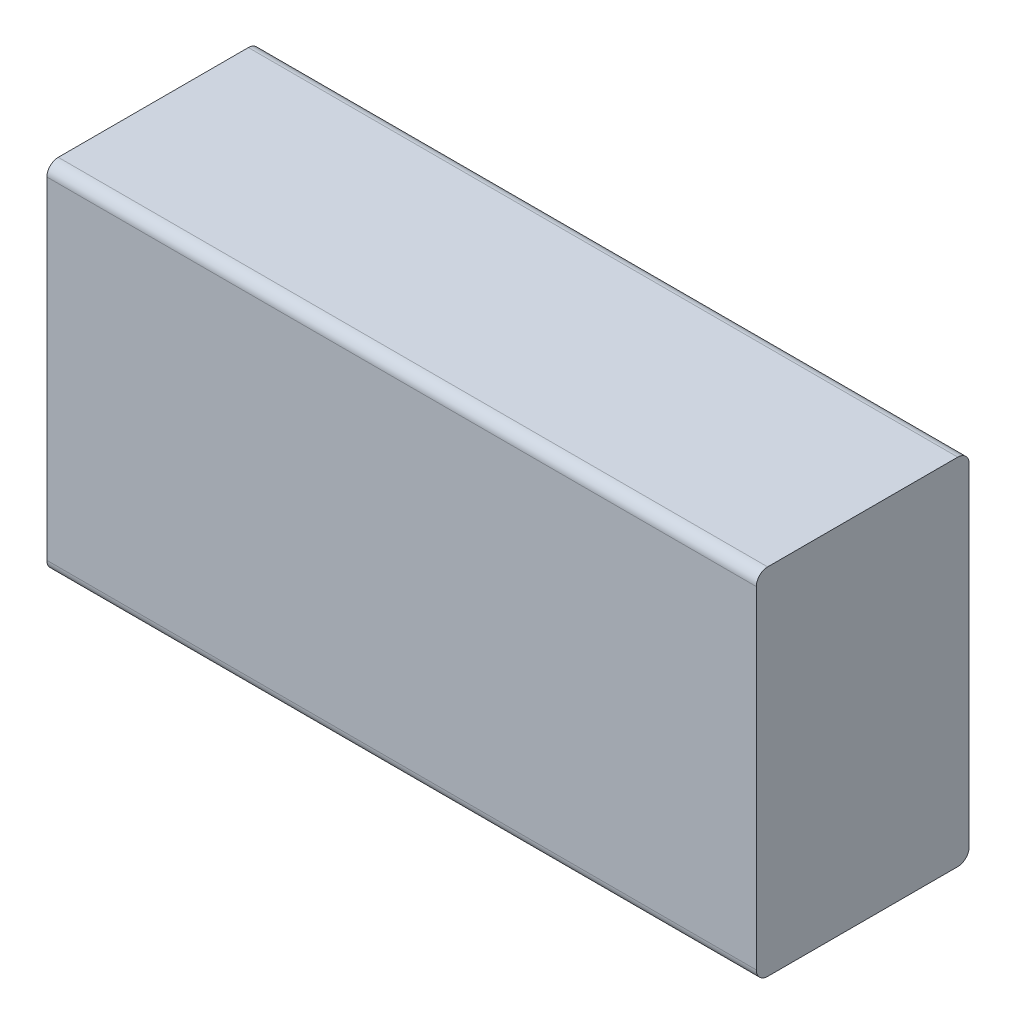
from build123d import *

# Parameters (mm, degrees)
EXTRUDE1_DEPTH = 3
SKETCH2_W      = 10
SKETCH2_H      = 5
EXTRUDE2_DEPTH = 3
FILLET1_R      = 0.16


with BuildPart() as part:
    # Sketch1 → Extrude1 (new body)
    with BuildSketch(Plane.XY):
        with BuildLine():
            Line((0, 2.5), (-7.5, 2.5))
            Line((-7.5, 2.5), (-7.5, -2.5))
            Line((-7.5, -2.5), (0, -2.5))
            ThreePointArc((0, -2.5), (2.5, 0), (0, 2.5))
        make_face()
    extrude(amount=EXTRUDE1_DEPTH)

    # Sketch2 → Extrude2 (add)
    with BuildSketch(Plane.XY):
        with Locations((-2.5, 0)):
            Rectangle(SKETCH2_W, SKETCH2_H)
    extrude(amount=EXTRUDE2_DEPTH)

    # Fillet1
    fillet1_edges = [part.edges().sort_by_distance(p)[0] for p in [
        (-2.5, -2.5, 3),
        (-2.5, -2.5, 0),
        (-2.5, 2.5, 0),
        (-2.5, 2.5, 3),
    ]]
    fillet(fillet1_edges, radius=FILLET1_R)


solid = part.part
